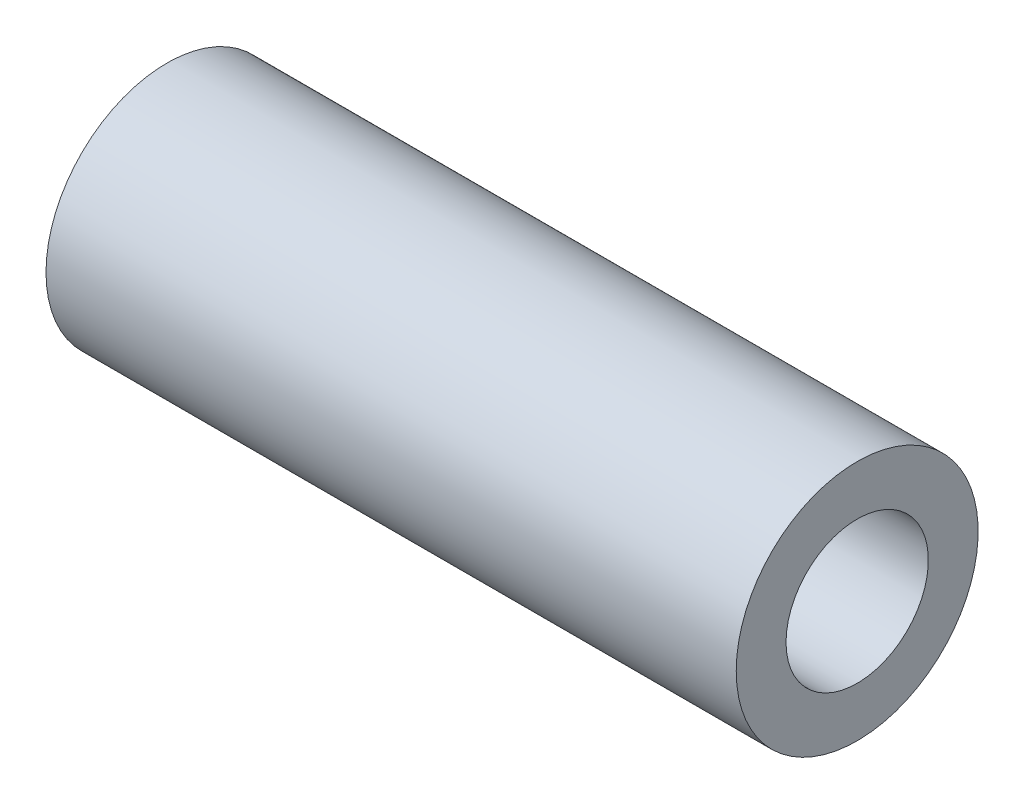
ISO-10303-21;
HEADER;
FILE_DESCRIPTION(('STEP AP214'),'2;1');
FILE_NAME('part.step','',(''),(''),'','','');
FILE_SCHEMA(('AUTOMOTIVE_DESIGN { 1 0 10303 214 1 1 1 1 }'));
ENDSEC;
DATA;
#1=APPLICATION_CONTEXT('core data for automotive mechanical design processes');
#2=APPLICATION_PROTOCOL_DEFINITION('international standard','automotive_design',2000,#1);
#3=PRODUCT_CONTEXT('',#1,'mechanical');
#4=PRODUCT('Part','Part','',(#3));
#5=PRODUCT_RELATED_PRODUCT_CATEGORY('part','',(#4));
#6=PRODUCT_DEFINITION_FORMATION('','',#4);
#7=PRODUCT_DEFINITION_CONTEXT('part definition',#1,'design');
#8=PRODUCT_DEFINITION('design','',#6,#7);
#9=PRODUCT_DEFINITION_SHAPE('','',#8);
#10=(LENGTH_UNIT() NAMED_UNIT(*) SI_UNIT(.MILLI.,.METRE.));
#11=(NAMED_UNIT(*) PLANE_ANGLE_UNIT() SI_UNIT($,.RADIAN.));
#12=(NAMED_UNIT(*) SI_UNIT($,.STERADIAN.) SOLID_ANGLE_UNIT());
#13=UNCERTAINTY_MEASURE_WITH_UNIT(LENGTH_MEASURE(1.E-05),#10,'distance_accuracy_value','');
#14=(GEOMETRIC_REPRESENTATION_CONTEXT(3) GLOBAL_UNCERTAINTY_ASSIGNED_CONTEXT((#13)) GLOBAL_UNIT_ASSIGNED_CONTEXT((#10,
#11,#12)) REPRESENTATION_CONTEXT('',''));
#15=CARTESIAN_POINT('',(0.,0.,0.));
#16=DIRECTION('',(0.,0.,1.));
#17=DIRECTION('',(1.,0.,0.));
#18=AXIS2_PLACEMENT_3D('',#15,#16,#17);
#19=CARTESIAN_POINT('',(-25.5720184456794,0.,0.));
#20=DIRECTION('',(-1.,0.,0.));
#21=DIRECTION('',(0.,0.,1.));
#22=AXIS2_PLACEMENT_3D('',#19,#20,#21);
#23=CYLINDRICAL_SURFACE('',#22,8.5);
#24=CARTESIAN_POINT('',(-18.3801768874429,0.,0.));
#25=DIRECTION('',(-1.,0.,0.));
#26=DIRECTION('',(0.,0.,1.));
#27=AXIS2_PLACEMENT_3D('',#24,#25,#26);
#28=CIRCLE('',#27,8.5);
#29=CARTESIAN_POINT('',(-18.3801768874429,0.,8.5));
#30=VERTEX_POINT('',#29);
#31=EDGE_CURVE('E54',#30,#30,#28,.T.);
#32=ORIENTED_EDGE('',*,*,#31,.F.);
#33=EDGE_LOOP('',(#32));
#34=FACE_BOUND('',#33,.T.);
#35=CARTESIAN_POINT('',(30.1198231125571,0.,0.));
#36=DIRECTION('',(-1.,0.,0.));
#37=DIRECTION('',(0.,0.,1.));
#38=AXIS2_PLACEMENT_3D('',#35,#36,#37);
#39=CIRCLE('',#38,8.5);
#40=CARTESIAN_POINT('',(30.1198231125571,0.,8.5));
#41=VERTEX_POINT('',#40);
#42=EDGE_CURVE('E10',#41,#41,#39,.T.);
#43=ORIENTED_EDGE('',*,*,#42,.T.);
#44=EDGE_LOOP('',(#43));
#45=FACE_BOUND('',#44,.T.);
#46=ADVANCED_FACE('F37',(#34,#45),#23,.T.);
#47=CARTESIAN_POINT('',(30.1198231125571,8.5,0.));
#48=DIRECTION('',(-1.,0.,0.));
#49=DIRECTION('',(0.,0.,1.));
#50=AXIS2_PLACEMENT_3D('',#47,#48,#49);
#51=PLANE('',#50);
#52=ORIENTED_EDGE('',*,*,#42,.F.);
#53=EDGE_LOOP('',(#52));
#54=FACE_BOUND('',#53,.T.);
#55=CARTESIAN_POINT('',(30.1198231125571,0.,0.));
#56=DIRECTION('',(-1.,0.,0.));
#57=DIRECTION('',(0.,0.,1.));
#58=AXIS2_PLACEMENT_3D('',#55,#56,#57);
#59=CIRCLE('',#58,5.);
#60=CARTESIAN_POINT('',(30.1198231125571,0.,5.));
#61=VERTEX_POINT('',#60);
#62=EDGE_CURVE('E44',#61,#61,#59,.T.);
#63=ORIENTED_EDGE('',*,*,#62,.T.);
#64=EDGE_LOOP('',(#63));
#65=FACE_BOUND('',#64,.T.);
#66=ADVANCED_FACE('F64',(#54,#65),#51,.F.);
#67=CARTESIAN_POINT('',(-25.5720184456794,0.,0.));
#68=DIRECTION('',(-1.,0.,0.));
#69=DIRECTION('',(0.,0.,1.));
#70=AXIS2_PLACEMENT_3D('',#67,#68,#69);
#71=CYLINDRICAL_SURFACE('',#70,5.);
#72=ORIENTED_EDGE('',*,*,#62,.F.);
#73=EDGE_LOOP('',(#72));
#74=FACE_BOUND('',#73,.T.);
#75=CARTESIAN_POINT('',(-18.3801768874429,0.,0.));
#76=DIRECTION('',(-1.,0.,0.));
#77=DIRECTION('',(0.,0.,1.));
#78=AXIS2_PLACEMENT_3D('',#75,#76,#77);
#79=CIRCLE('',#78,5.);
#80=CARTESIAN_POINT('',(-18.3801768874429,0.,5.));
#81=VERTEX_POINT('',#80);
#82=EDGE_CURVE('E49',#81,#81,#79,.T.);
#83=ORIENTED_EDGE('',*,*,#82,.T.);
#84=EDGE_LOOP('',(#83));
#85=FACE_BOUND('',#84,.T.);
#86=ADVANCED_FACE('F68',(#74,#85),#71,.F.);
#87=CARTESIAN_POINT('',(-18.3801768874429,5.,0.));
#88=DIRECTION('',(1.,0.,0.));
#89=DIRECTION('',(0.,0.,-1.));
#90=AXIS2_PLACEMENT_3D('',#87,#88,#89);
#91=PLANE('',#90);
#92=ORIENTED_EDGE('',*,*,#82,.F.);
#93=EDGE_LOOP('',(#92));
#94=FACE_BOUND('',#93,.T.);
#95=ORIENTED_EDGE('',*,*,#31,.T.);
#96=EDGE_LOOP('',(#95));
#97=FACE_BOUND('',#96,.T.);
#98=ADVANCED_FACE('F61',(#94,#97),#91,.F.);
#99=CLOSED_SHELL('',(#46,#66,#86,#98));
#100=MANIFOLD_SOLID_BREP('B2',#99);
#101=ADVANCED_BREP_SHAPE_REPRESENTATION('',(#18,#100),#14);
#102=SHAPE_DEFINITION_REPRESENTATION(#9,#101);
ENDSEC;
END-ISO-10303-21;
